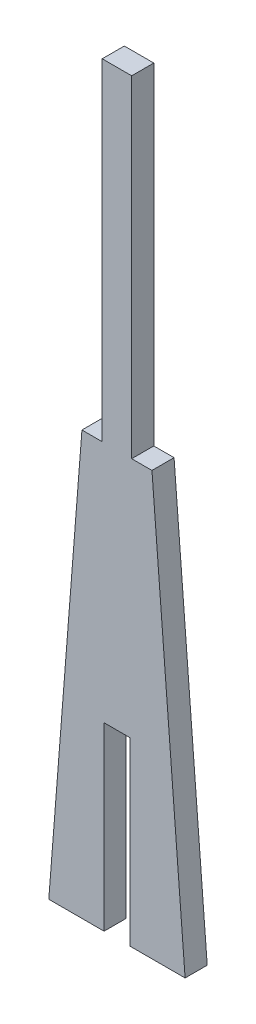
ISO-10303-21;
HEADER;
FILE_DESCRIPTION(('STEP AP214'),'2;1');
FILE_NAME('part.step','',(''),(''),'','','');
FILE_SCHEMA(('AUTOMOTIVE_DESIGN { 1 0 10303 214 1 1 1 1 }'));
ENDSEC;
DATA;
#1=APPLICATION_CONTEXT('core data for automotive mechanical design processes');
#2=APPLICATION_PROTOCOL_DEFINITION('international standard','automotive_design',2000,#1);
#3=PRODUCT_CONTEXT('',#1,'mechanical');
#4=PRODUCT('Part','Part','',(#3));
#5=PRODUCT_RELATED_PRODUCT_CATEGORY('part','',(#4));
#6=PRODUCT_DEFINITION_FORMATION('','',#4);
#7=PRODUCT_DEFINITION_CONTEXT('part definition',#1,'design');
#8=PRODUCT_DEFINITION('design','',#6,#7);
#9=PRODUCT_DEFINITION_SHAPE('','',#8);
#10=(LENGTH_UNIT() NAMED_UNIT(*) SI_UNIT(.MILLI.,.METRE.));
#11=(NAMED_UNIT(*) PLANE_ANGLE_UNIT() SI_UNIT($,.RADIAN.));
#12=(NAMED_UNIT(*) SI_UNIT($,.STERADIAN.) SOLID_ANGLE_UNIT());
#13=UNCERTAINTY_MEASURE_WITH_UNIT(LENGTH_MEASURE(1.E-05),#10,'distance_accuracy_value','');
#14=(GEOMETRIC_REPRESENTATION_CONTEXT(3) GLOBAL_UNCERTAINTY_ASSIGNED_CONTEXT((#13)) GLOBAL_UNIT_ASSIGNED_CONTEXT((#10,
#11,#12)) REPRESENTATION_CONTEXT('',''));
#15=CARTESIAN_POINT('',(0.,0.,0.));
#16=DIRECTION('',(0.,0.,1.));
#17=DIRECTION('',(1.,0.,0.));
#18=AXIS2_PLACEMENT_3D('',#15,#16,#17);
#19=CARTESIAN_POINT('',(0.,24.5,3.));
#20=DIRECTION('',(0.,1.,0.));
#21=DIRECTION('',(0.,0.,1.));
#22=AXIS2_PLACEMENT_3D('',#19,#20,#21);
#23=PLANE('',#22);
#24=DIRECTION('',(1.,0.,0.));
#25=VECTOR('',#24,1.);
#26=CARTESIAN_POINT('',(0.,24.5,0.));
#27=LINE('',#26,#25);
#28=CARTESIAN_POINT('',(-1.75,24.5,0.));
#29=VERTEX_POINT('',#28);
#30=CARTESIAN_POINT('',(1.75,24.5,0.));
#31=VERTEX_POINT('',#30);
#32=EDGE_CURVE('E236',#29,#31,#27,.T.);
#33=ORIENTED_EDGE('',*,*,#32,.T.);
#34=DIRECTION('',(0.,0.,-1.));
#35=VECTOR('',#34,1.);
#36=CARTESIAN_POINT('',(1.75,24.5,3.));
#37=LINE('',#36,#35);
#38=CARTESIAN_POINT('',(1.75,24.5,3.));
#39=VERTEX_POINT('',#38);
#40=EDGE_CURVE('E11',#39,#31,#37,.T.);
#41=ORIENTED_EDGE('',*,*,#40,.F.);
#42=DIRECTION('',(1.,0.,0.));
#43=VECTOR('',#42,1.);
#44=CARTESIAN_POINT('',(0.,24.5,3.));
#45=LINE('',#44,#43);
#46=CARTESIAN_POINT('',(-1.75,24.5,3.));
#47=VERTEX_POINT('',#46);
#48=EDGE_CURVE('E180',#47,#39,#45,.T.);
#49=ORIENTED_EDGE('',*,*,#48,.F.);
#50=DIRECTION('',(0.,0.,-1.));
#51=VECTOR('',#50,1.);
#52=CARTESIAN_POINT('',(-1.75,24.5,3.));
#53=LINE('',#52,#51);
#54=EDGE_CURVE('E62',#47,#29,#53,.T.);
#55=ORIENTED_EDGE('',*,*,#54,.T.);
#56=EDGE_LOOP('',(#33,#41,#49,#55));
#57=FACE_BOUND('',#56,.T.);
#58=ADVANCED_FACE('F45',(#57),#23,.F.);
#59=CARTESIAN_POINT('',(1.75,0.,3.));
#60=DIRECTION('',(1.,0.,0.));
#61=DIRECTION('',(0.,1.,0.));
#62=AXIS2_PLACEMENT_3D('',#59,#60,#61);
#63=PLANE('',#62);
#64=DIRECTION('',(0.,-1.,0.));
#65=VECTOR('',#64,1.);
#66=CARTESIAN_POINT('',(1.75,0.,0.));
#67=LINE('',#66,#65);
#68=CARTESIAN_POINT('',(1.75,0.,0.));
#69=VERTEX_POINT('',#68);
#70=EDGE_CURVE('E227',#31,#69,#67,.T.);
#71=ORIENTED_EDGE('',*,*,#70,.T.);
#72=DIRECTION('',(0.,0.,-1.));
#73=VECTOR('',#72,1.);
#74=CARTESIAN_POINT('',(1.75,0.,3.));
#75=LINE('',#74,#73);
#76=CARTESIAN_POINT('',(1.75,0.,3.));
#77=VERTEX_POINT('',#76);
#78=EDGE_CURVE('E54',#77,#69,#75,.T.);
#79=ORIENTED_EDGE('',*,*,#78,.F.);
#80=DIRECTION('',(0.,-1.,0.));
#81=VECTOR('',#80,1.);
#82=CARTESIAN_POINT('',(1.75,0.,3.));
#83=LINE('',#82,#81);
#84=EDGE_CURVE('E113',#39,#77,#83,.T.);
#85=ORIENTED_EDGE('',*,*,#84,.F.);
#86=ORIENTED_EDGE('',*,*,#40,.T.);
#87=EDGE_LOOP('',(#71,#79,#85,#86));
#88=FACE_BOUND('',#87,.T.);
#89=ADVANCED_FACE('F293',(#88),#63,.F.);
#90=CARTESIAN_POINT('',(0.,0.,3.));
#91=DIRECTION('',(0.,1.,0.));
#92=DIRECTION('',(0.,0.,1.));
#93=AXIS2_PLACEMENT_3D('',#90,#91,#92);
#94=PLANE('',#93);
#95=DIRECTION('',(1.,0.,0.));
#96=VECTOR('',#95,1.);
#97=CARTESIAN_POINT('',(0.,0.,0.));
#98=LINE('',#97,#96);
#99=CARTESIAN_POINT('',(9.25,0.,0.));
#100=VERTEX_POINT('',#99);
#101=EDGE_CURVE('E192',#69,#100,#98,.T.);
#102=ORIENTED_EDGE('',*,*,#101,.T.);
#103=DIRECTION('',(0.,0.,-1.));
#104=VECTOR('',#103,1.);
#105=CARTESIAN_POINT('',(9.25,0.,3.));
#106=LINE('',#105,#104);
#107=CARTESIAN_POINT('',(9.25,0.,3.));
#108=VERTEX_POINT('',#107);
#109=EDGE_CURVE('E217',#108,#100,#106,.T.);
#110=ORIENTED_EDGE('',*,*,#109,.F.);
#111=DIRECTION('',(1.,0.,0.));
#112=VECTOR('',#111,1.);
#113=CARTESIAN_POINT('',(0.,0.,3.));
#114=LINE('',#113,#112);
#115=EDGE_CURVE('E166',#77,#108,#114,.T.);
#116=ORIENTED_EDGE('',*,*,#115,.F.);
#117=ORIENTED_EDGE('',*,*,#78,.T.);
#118=EDGE_LOOP('',(#102,#110,#116,#117));
#119=FACE_BOUND('',#118,.T.);
#120=ADVANCED_FACE('F224',(#119),#94,.F.);
#121=CARTESIAN_POINT('',(9.19349564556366,0.720744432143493,3.));
#122=DIRECTION('',(0.996941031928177,0.0781573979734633,0.));
#123=DIRECTION('',(-0.0781573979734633,0.996941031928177,0.));
#124=AXIS2_PLACEMENT_3D('',#121,#122,#123);
#125=PLANE('',#124);
#126=DIRECTION('',(0.0781573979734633,-0.996941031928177,0.));
#127=VECTOR('',#126,1.);
#128=CARTESIAN_POINT('',(9.19349564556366,0.720744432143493,0.));
#129=LINE('',#128,#127);
#130=CARTESIAN_POINT('',(4.75,57.4,0.));
#131=VERTEX_POINT('',#130);
#132=EDGE_CURVE('E230',#131,#100,#129,.T.);
#133=ORIENTED_EDGE('',*,*,#132,.F.);
#134=DIRECTION('',(0.,0.,-1.));
#135=VECTOR('',#134,1.);
#136=CARTESIAN_POINT('',(4.75,57.4,3.));
#137=LINE('',#136,#135);
#138=CARTESIAN_POINT('',(4.75,57.4,3.));
#139=VERTEX_POINT('',#138);
#140=EDGE_CURVE('E214',#139,#131,#137,.T.);
#141=ORIENTED_EDGE('',*,*,#140,.F.);
#142=DIRECTION('',(0.0781573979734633,-0.996941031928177,0.));
#143=VECTOR('',#142,1.);
#144=CARTESIAN_POINT('',(9.19349564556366,0.720744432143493,3.));
#145=LINE('',#144,#143);
#146=EDGE_CURVE('E172',#139,#108,#145,.T.);
#147=ORIENTED_EDGE('',*,*,#146,.T.);
#148=ORIENTED_EDGE('',*,*,#109,.T.);
#149=EDGE_LOOP('',(#133,#141,#147,#148));
#150=FACE_BOUND('',#149,.T.);
#151=ADVANCED_FACE('F300',(#150),#125,.T.);
#152=CARTESIAN_POINT('',(0.,57.4,3.));
#153=DIRECTION('',(0.,1.,0.));
#154=DIRECTION('',(0.,0.,1.));
#155=AXIS2_PLACEMENT_3D('',#152,#153,#154);
#156=PLANE('',#155);
#157=DIRECTION('',(1.,0.,0.));
#158=VECTOR('',#157,1.);
#159=CARTESIAN_POINT('',(0.,57.4,0.));
#160=LINE('',#159,#158);
#161=CARTESIAN_POINT('',(1.99999999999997,57.4,0.));
#162=VERTEX_POINT('',#161);
#163=EDGE_CURVE('E234',#162,#131,#160,.T.);
#164=ORIENTED_EDGE('',*,*,#163,.F.);
#165=DIRECTION('',(0.,0.,-1.));
#166=VECTOR('',#165,1.);
#167=CARTESIAN_POINT('',(1.99999999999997,57.4,3.));
#168=LINE('',#167,#166);
#169=CARTESIAN_POINT('',(1.99999999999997,57.4,3.));
#170=VERTEX_POINT('',#169);
#171=EDGE_CURVE('E211',#170,#162,#168,.T.);
#172=ORIENTED_EDGE('',*,*,#171,.F.);
#173=DIRECTION('',(1.,0.,0.));
#174=VECTOR('',#173,1.);
#175=CARTESIAN_POINT('',(0.,57.4,3.));
#176=LINE('',#175,#174);
#177=EDGE_CURVE('E179',#170,#139,#176,.T.);
#178=ORIENTED_EDGE('',*,*,#177,.T.);
#179=ORIENTED_EDGE('',*,*,#140,.T.);
#180=EDGE_LOOP('',(#164,#172,#178,#179));
#181=FACE_BOUND('',#180,.T.);
#182=ADVANCED_FACE('F304',(#181),#156,.T.);
#183=CARTESIAN_POINT('',(1.99999999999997,0.,3.));
#184=DIRECTION('',(1.,0.,0.));
#185=DIRECTION('',(0.,0.,-1.));
#186=AXIS2_PLACEMENT_3D('',#183,#184,#185);
#187=PLANE('',#186);
#188=DIRECTION('',(0.,-1.,0.));
#189=VECTOR('',#188,1.);
#190=CARTESIAN_POINT('',(1.99999999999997,0.,0.));
#191=LINE('',#190,#189);
#192=CARTESIAN_POINT('',(1.99999999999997,102.4,0.));
#193=VERTEX_POINT('',#192);
#194=EDGE_CURVE('E242',#193,#162,#191,.T.);
#195=ORIENTED_EDGE('',*,*,#194,.F.);
#196=DIRECTION('',(0.,0.,-1.));
#197=VECTOR('',#196,1.);
#198=CARTESIAN_POINT('',(1.99999999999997,102.4,3.));
#199=LINE('',#198,#197);
#200=CARTESIAN_POINT('',(1.99999999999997,102.4,3.));
#201=VERTEX_POINT('',#200);
#202=EDGE_CURVE('E208',#201,#193,#199,.T.);
#203=ORIENTED_EDGE('',*,*,#202,.F.);
#204=DIRECTION('',(0.,-1.,0.));
#205=VECTOR('',#204,1.);
#206=CARTESIAN_POINT('',(1.99999999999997,0.,3.));
#207=LINE('',#206,#205);
#208=EDGE_CURVE('E274',#201,#170,#207,.T.);
#209=ORIENTED_EDGE('',*,*,#208,.T.);
#210=ORIENTED_EDGE('',*,*,#171,.T.);
#211=EDGE_LOOP('',(#195,#203,#209,#210));
#212=FACE_BOUND('',#211,.T.);
#213=ADVANCED_FACE('F306',(#212),#187,.T.);
#214=CARTESIAN_POINT('',(0.,102.4,3.));
#215=DIRECTION('',(0.,1.,0.));
#216=DIRECTION('',(0.,0.,1.));
#217=AXIS2_PLACEMENT_3D('',#214,#215,#216);
#218=PLANE('',#217);
#219=DIRECTION('',(1.,0.,0.));
#220=VECTOR('',#219,1.);
#221=CARTESIAN_POINT('',(0.,102.4,0.));
#222=LINE('',#221,#220);
#223=CARTESIAN_POINT('',(-2.00000000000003,102.4,0.));
#224=VERTEX_POINT('',#223);
#225=EDGE_CURVE('E247',#224,#193,#222,.T.);
#226=ORIENTED_EDGE('',*,*,#225,.F.);
#227=DIRECTION('',(0.,0.,-1.));
#228=VECTOR('',#227,1.);
#229=CARTESIAN_POINT('',(-2.00000000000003,102.4,3.));
#230=LINE('',#229,#228);
#231=CARTESIAN_POINT('',(-2.00000000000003,102.4,3.));
#232=VERTEX_POINT('',#231);
#233=EDGE_CURVE('E205',#232,#224,#230,.T.);
#234=ORIENTED_EDGE('',*,*,#233,.F.);
#235=DIRECTION('',(1.,0.,0.));
#236=VECTOR('',#235,1.);
#237=CARTESIAN_POINT('',(0.,102.4,3.));
#238=LINE('',#237,#236);
#239=EDGE_CURVE('E268',#232,#201,#238,.T.);
#240=ORIENTED_EDGE('',*,*,#239,.T.);
#241=ORIENTED_EDGE('',*,*,#202,.T.);
#242=EDGE_LOOP('',(#226,#234,#240,#241));
#243=FACE_BOUND('',#242,.T.);
#244=ADVANCED_FACE('F309',(#243),#218,.T.);
#245=CARTESIAN_POINT('',(-2.00000000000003,0.,3.));
#246=DIRECTION('',(1.,0.,0.));
#247=DIRECTION('',(0.,0.,-1.));
#248=AXIS2_PLACEMENT_3D('',#245,#246,#247);
#249=PLANE('',#248);
#250=DIRECTION('',(0.,-1.,0.));
#251=VECTOR('',#250,1.);
#252=CARTESIAN_POINT('',(-2.00000000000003,0.,0.));
#253=LINE('',#252,#251);
#254=CARTESIAN_POINT('',(-2.00000000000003,57.4,0.));
#255=VERTEX_POINT('',#254);
#256=EDGE_CURVE('E250',#224,#255,#253,.T.);
#257=ORIENTED_EDGE('',*,*,#256,.T.);
#258=DIRECTION('',(0.,0.,-1.));
#259=VECTOR('',#258,1.);
#260=CARTESIAN_POINT('',(-2.00000000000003,57.4,3.));
#261=LINE('',#260,#259);
#262=CARTESIAN_POINT('',(-2.00000000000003,57.4,3.));
#263=VERTEX_POINT('',#262);
#264=EDGE_CURVE('E202',#263,#255,#261,.T.);
#265=ORIENTED_EDGE('',*,*,#264,.F.);
#266=DIRECTION('',(0.,-1.,0.));
#267=VECTOR('',#266,1.);
#268=CARTESIAN_POINT('',(-2.00000000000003,0.,3.));
#269=LINE('',#268,#267);
#270=EDGE_CURVE('E265',#232,#263,#269,.T.);
#271=ORIENTED_EDGE('',*,*,#270,.F.);
#272=ORIENTED_EDGE('',*,*,#233,.T.);
#273=EDGE_LOOP('',(#257,#265,#271,#272));
#274=FACE_BOUND('',#273,.T.);
#275=ADVANCED_FACE('F264',(#274),#249,.F.);
#276=CARTESIAN_POINT('',(-4.75,57.4,0.));
#277=VERTEX_POINT('',#276);
#278=EDGE_CURVE('E243',#277,#255,#160,.T.);
#279=ORIENTED_EDGE('',*,*,#278,.F.);
#280=DIRECTION('',(0.,0.,-1.));
#281=VECTOR('',#280,1.);
#282=CARTESIAN_POINT('',(-4.75,57.4,3.));
#283=LINE('',#282,#281);
#284=CARTESIAN_POINT('',(-4.75,57.4,3.));
#285=VERTEX_POINT('',#284);
#286=EDGE_CURVE('E160',#285,#277,#283,.T.);
#287=ORIENTED_EDGE('',*,*,#286,.F.);
#288=EDGE_CURVE('E148',#285,#263,#176,.T.);
#289=ORIENTED_EDGE('',*,*,#288,.T.);
#290=ORIENTED_EDGE('',*,*,#264,.T.);
#291=EDGE_LOOP('',(#279,#287,#289,#290));
#292=FACE_BOUND('',#291,.T.);
#293=ADVANCED_FACE('F262',(#292),#156,.T.);
#294=CARTESIAN_POINT('',(-9.19349564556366,0.720744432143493,3.));
#295=DIRECTION('',(0.996941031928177,-0.0781573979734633,0.));
#296=DIRECTION('',(0.0781573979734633,0.996941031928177,0.));
#297=AXIS2_PLACEMENT_3D('',#294,#295,#296);
#298=PLANE('',#297);
#299=DIRECTION('',(-0.0781573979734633,-0.996941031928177,0.));
#300=VECTOR('',#299,1.);
#301=CARTESIAN_POINT('',(-9.19349564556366,0.720744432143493,0.));
#302=LINE('',#301,#300);
#303=CARTESIAN_POINT('',(-9.25,0.,0.));
#304=VERTEX_POINT('',#303);
#305=EDGE_CURVE('E156',#277,#304,#302,.T.);
#306=ORIENTED_EDGE('',*,*,#305,.T.);
#307=DIRECTION('',(0.,0.,-1.));
#308=VECTOR('',#307,1.);
#309=CARTESIAN_POINT('',(-9.25,0.,3.));
#310=LINE('',#309,#308);
#311=CARTESIAN_POINT('',(-9.25,0.,3.));
#312=VERTEX_POINT('',#311);
#313=EDGE_CURVE('E153',#312,#304,#310,.T.);
#314=ORIENTED_EDGE('',*,*,#313,.F.);
#315=DIRECTION('',(-0.0781573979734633,-0.996941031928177,0.));
#316=VECTOR('',#315,1.);
#317=CARTESIAN_POINT('',(-9.19349564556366,0.720744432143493,3.));
#318=LINE('',#317,#316);
#319=EDGE_CURVE('E141',#285,#312,#318,.T.);
#320=ORIENTED_EDGE('',*,*,#319,.F.);
#321=ORIENTED_EDGE('',*,*,#286,.T.);
#322=EDGE_LOOP('',(#306,#314,#320,#321));
#323=FACE_BOUND('',#322,.T.);
#324=ADVANCED_FACE('F154',(#323),#298,.F.);
#325=CARTESIAN_POINT('',(-1.75,0.,0.));
#326=VERTEX_POINT('',#325);
#327=EDGE_CURVE('E187',#304,#326,#98,.T.);
#328=ORIENTED_EDGE('',*,*,#327,.T.);
#329=DIRECTION('',(0.,0.,-1.));
#330=VECTOR('',#329,1.);
#331=CARTESIAN_POINT('',(-1.75,0.,3.));
#332=LINE('',#331,#330);
#333=CARTESIAN_POINT('',(-1.75,0.,3.));
#334=VERTEX_POINT('',#333);
#335=EDGE_CURVE('E101',#334,#326,#332,.T.);
#336=ORIENTED_EDGE('',*,*,#335,.F.);
#337=EDGE_CURVE('E146',#312,#334,#114,.T.);
#338=ORIENTED_EDGE('',*,*,#337,.F.);
#339=ORIENTED_EDGE('',*,*,#313,.T.);
#340=EDGE_LOOP('',(#328,#336,#338,#339));
#341=FACE_BOUND('',#340,.T.);
#342=ADVANCED_FACE('F162',(#341),#94,.F.);
#343=CARTESIAN_POINT('',(-1.75,0.,3.));
#344=DIRECTION('',(1.,0.,0.));
#345=DIRECTION('',(0.,1.,0.));
#346=AXIS2_PLACEMENT_3D('',#343,#344,#345);
#347=PLANE('',#346);
#348=DIRECTION('',(0.,-1.,0.));
#349=VECTOR('',#348,1.);
#350=CARTESIAN_POINT('',(-1.75,0.,0.));
#351=LINE('',#350,#349);
#352=EDGE_CURVE('E182',#29,#326,#351,.T.);
#353=ORIENTED_EDGE('',*,*,#352,.F.);
#354=ORIENTED_EDGE('',*,*,#54,.F.);
#355=DIRECTION('',(0.,-1.,0.));
#356=VECTOR('',#355,1.);
#357=CARTESIAN_POINT('',(-1.75,0.,3.));
#358=LINE('',#357,#356);
#359=EDGE_CURVE('E164',#47,#334,#358,.T.);
#360=ORIENTED_EDGE('',*,*,#359,.T.);
#361=ORIENTED_EDGE('',*,*,#335,.T.);
#362=EDGE_LOOP('',(#353,#354,#360,#361));
#363=FACE_BOUND('',#362,.T.);
#364=ADVANCED_FACE('F282',(#363),#347,.T.);
#365=CARTESIAN_POINT('',(0.,0.,3.));
#366=DIRECTION('',(0.,0.,1.));
#367=DIRECTION('',(1.,0.,0.));
#368=AXIS2_PLACEMENT_3D('',#365,#366,#367);
#369=PLANE('',#368);
#370=ORIENTED_EDGE('',*,*,#48,.T.);
#371=ORIENTED_EDGE('',*,*,#84,.T.);
#372=ORIENTED_EDGE('',*,*,#115,.T.);
#373=ORIENTED_EDGE('',*,*,#146,.F.);
#374=ORIENTED_EDGE('',*,*,#177,.F.);
#375=ORIENTED_EDGE('',*,*,#208,.F.);
#376=ORIENTED_EDGE('',*,*,#239,.F.);
#377=ORIENTED_EDGE('',*,*,#270,.T.);
#378=ORIENTED_EDGE('',*,*,#288,.F.);
#379=ORIENTED_EDGE('',*,*,#319,.T.);
#380=ORIENTED_EDGE('',*,*,#337,.T.);
#381=ORIENTED_EDGE('',*,*,#359,.F.);
#382=EDGE_LOOP('',(#370,#371,#372,#373,#374,#375,#376,#377,#378,#379,#380,#381));
#383=FACE_BOUND('',#382,.T.);
#384=ADVANCED_FACE('F143',(#383),#369,.T.);
#385=CARTESIAN_POINT('',(0.,0.,0.));
#386=DIRECTION('',(0.,0.,1.));
#387=DIRECTION('',(1.,0.,0.));
#388=AXIS2_PLACEMENT_3D('',#385,#386,#387);
#389=PLANE('',#388);
#390=ORIENTED_EDGE('',*,*,#32,.F.);
#391=ORIENTED_EDGE('',*,*,#352,.T.);
#392=ORIENTED_EDGE('',*,*,#327,.F.);
#393=ORIENTED_EDGE('',*,*,#305,.F.);
#394=ORIENTED_EDGE('',*,*,#278,.T.);
#395=ORIENTED_EDGE('',*,*,#256,.F.);
#396=ORIENTED_EDGE('',*,*,#225,.T.);
#397=ORIENTED_EDGE('',*,*,#194,.T.);
#398=ORIENTED_EDGE('',*,*,#163,.T.);
#399=ORIENTED_EDGE('',*,*,#132,.T.);
#400=ORIENTED_EDGE('',*,*,#101,.F.);
#401=ORIENTED_EDGE('',*,*,#70,.F.);
#402=EDGE_LOOP('',(#390,#391,#392,#393,#394,#395,#396,#397,#398,#399,#400,#401));
#403=FACE_BOUND('',#402,.T.);
#404=ADVANCED_FACE('F226',(#403),#389,.F.);
#405=CLOSED_SHELL('',(#58,#89,#120,#151,#182,#213,#244,#275,#293,#324,#342,#364,#384,#404));
#406=MANIFOLD_SOLID_BREP('B2',#405);
#407=ADVANCED_BREP_SHAPE_REPRESENTATION('',(#18,#406),#14);
#408=SHAPE_DEFINITION_REPRESENTATION(#9,#407);
ENDSEC;
END-ISO-10303-21;
